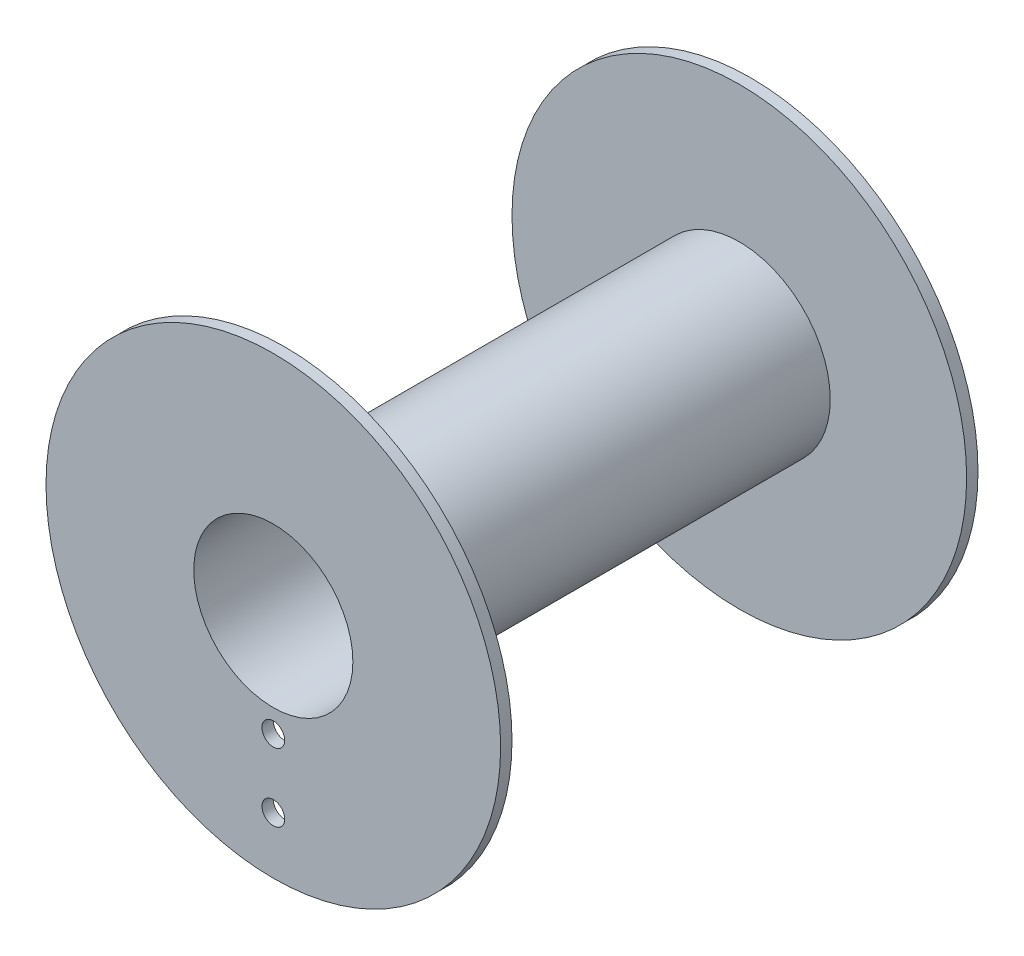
ISO-10303-21;
HEADER;
FILE_DESCRIPTION(('STEP AP214'),'2;1');
FILE_NAME('part.step','',(''),(''),'','','');
FILE_SCHEMA(('AUTOMOTIVE_DESIGN { 1 0 10303 214 1 1 1 1 }'));
ENDSEC;
DATA;
#1=APPLICATION_CONTEXT('core data for automotive mechanical design processes');
#2=APPLICATION_PROTOCOL_DEFINITION('international standard','automotive_design',2000,#1);
#3=PRODUCT_CONTEXT('',#1,'mechanical');
#4=PRODUCT('Part','Part','',(#3));
#5=PRODUCT_RELATED_PRODUCT_CATEGORY('part','',(#4));
#6=PRODUCT_DEFINITION_FORMATION('','',#4);
#7=PRODUCT_DEFINITION_CONTEXT('part definition',#1,'design');
#8=PRODUCT_DEFINITION('design','',#6,#7);
#9=PRODUCT_DEFINITION_SHAPE('','',#8);
#10=(LENGTH_UNIT() NAMED_UNIT(*) SI_UNIT(.MILLI.,.METRE.));
#11=(NAMED_UNIT(*) PLANE_ANGLE_UNIT() SI_UNIT($,.RADIAN.));
#12=(NAMED_UNIT(*) SI_UNIT($,.STERADIAN.) SOLID_ANGLE_UNIT());
#13=UNCERTAINTY_MEASURE_WITH_UNIT(LENGTH_MEASURE(1.E-05),#10,'distance_accuracy_value','');
#14=(GEOMETRIC_REPRESENTATION_CONTEXT(3) GLOBAL_UNCERTAINTY_ASSIGNED_CONTEXT((#13)) GLOBAL_UNIT_ASSIGNED_CONTEXT((#10,
#11,#12)) REPRESENTATION_CONTEXT('',''));
#15=CARTESIAN_POINT('',(0.,0.,0.));
#16=DIRECTION('',(0.,0.,1.));
#17=DIRECTION('',(1.,0.,0.));
#18=AXIS2_PLACEMENT_3D('',#15,#16,#17);
#19=CARTESIAN_POINT('',(0.,0.,1.));
#20=DIRECTION('',(0.,0.,1.));
#21=DIRECTION('',(1.,0.,0.));
#22=AXIS2_PLACEMENT_3D('',#19,#20,#21);
#23=PLANE('',#22);
#24=CARTESIAN_POINT('',(0.,0.,1.));
#25=DIRECTION('',(0.,0.,1.));
#26=DIRECTION('',(1.,0.,0.));
#27=AXIS2_PLACEMENT_3D('',#24,#25,#26);
#28=CIRCLE('',#27,20.);
#29=CARTESIAN_POINT('',(20.,0.,1.));
#30=VERTEX_POINT('',#29);
#31=EDGE_CURVE('E11',#30,#30,#28,.T.);
#32=ORIENTED_EDGE('',*,*,#31,.T.);
#33=EDGE_LOOP('',(#32));
#34=FACE_BOUND('',#33,.T.);
#35=CARTESIAN_POINT('',(0.,0.,1.));
#36=DIRECTION('',(0.,0.,1.));
#37=DIRECTION('',(1.,0.,0.));
#38=AXIS2_PLACEMENT_3D('',#35,#36,#37);
#39=CIRCLE('',#38,8.);
#40=CARTESIAN_POINT('',(8.,0.,1.));
#41=VERTEX_POINT('',#40);
#42=EDGE_CURVE('E60',#41,#41,#39,.T.);
#43=ORIENTED_EDGE('',*,*,#42,.F.);
#44=EDGE_LOOP('',(#43));
#45=FACE_BOUND('',#44,.T.);
#46=ADVANCED_FACE('F26',(#34,#45),#23,.T.);
#47=CARTESIAN_POINT('',(0.,0.,1.));
#48=DIRECTION('',(0.,0.,-1.));
#49=DIRECTION('',(-1.,0.,0.));
#50=AXIS2_PLACEMENT_3D('',#47,#48,#49);
#51=CYLINDRICAL_SURFACE('',#50,20.);
#52=ORIENTED_EDGE('',*,*,#31,.F.);
#53=EDGE_LOOP('',(#52));
#54=FACE_BOUND('',#53,.T.);
#55=CARTESIAN_POINT('',(0.,0.,0.));
#56=DIRECTION('',(0.,0.,1.));
#57=DIRECTION('',(1.,0.,0.));
#58=AXIS2_PLACEMENT_3D('',#55,#56,#57);
#59=CIRCLE('',#58,20.);
#60=CARTESIAN_POINT('',(20.,0.,0.));
#61=VERTEX_POINT('',#60);
#62=EDGE_CURVE('E33',#61,#61,#59,.T.);
#63=ORIENTED_EDGE('',*,*,#62,.T.);
#64=EDGE_LOOP('',(#63));
#65=FACE_BOUND('',#64,.T.);
#66=ADVANCED_FACE('F28',(#54,#65),#51,.T.);
#67=CARTESIAN_POINT('',(0.,0.,0.));
#68=DIRECTION('',(0.,0.,1.));
#69=DIRECTION('',(1.,0.,0.));
#70=AXIS2_PLACEMENT_3D('',#67,#68,#69);
#71=PLANE('',#70);
#72=CARTESIAN_POINT('',(0.,0.,0.));
#73=DIRECTION('',(0.,0.,1.));
#74=DIRECTION('',(1.,0.,0.));
#75=AXIS2_PLACEMENT_3D('',#72,#73,#74);
#76=CIRCLE('',#75,7.);
#77=CARTESIAN_POINT('',(7.,0.,0.));
#78=VERTEX_POINT('',#77);
#79=EDGE_CURVE('E45',#78,#78,#76,.T.);
#80=ORIENTED_EDGE('',*,*,#79,.T.);
#81=EDGE_LOOP('',(#80));
#82=FACE_BOUND('',#81,.T.);
#83=ORIENTED_EDGE('',*,*,#62,.F.);
#84=EDGE_LOOP('',(#83));
#85=FACE_BOUND('',#84,.T.);
#86=ADVANCED_FACE('F68',(#82,#85),#71,.F.);
#87=CARTESIAN_POINT('',(0.,0.,41.));
#88=DIRECTION('',(0.,0.,-1.));
#89=DIRECTION('',(-1.,0.,0.));
#90=AXIS2_PLACEMENT_3D('',#87,#88,#89);
#91=CYLINDRICAL_SURFACE('',#90,8.);
#92=CARTESIAN_POINT('',(0.,0.,41.));
#93=DIRECTION('',(0.,0.,1.));
#94=DIRECTION('',(1.,0.,0.));
#95=AXIS2_PLACEMENT_3D('',#92,#93,#94);
#96=CIRCLE('',#95,8.);
#97=CARTESIAN_POINT('',(0.,-8.,41.));
#98=VERTEX_POINT('',#97);
#99=EDGE_CURVE('E63',#98,#98,#96,.T.);
#100=ORIENTED_EDGE('',*,*,#99,.F.);
#101=EDGE_LOOP('',(#100));
#102=FACE_BOUND('',#101,.T.);
#103=ORIENTED_EDGE('',*,*,#42,.T.);
#104=EDGE_LOOP('',(#103));
#105=FACE_BOUND('',#104,.T.);
#106=ADVANCED_FACE('F70',(#102,#105),#91,.T.);
#107=CARTESIAN_POINT('',(0.,0.,41.));
#108=DIRECTION('',(0.,0.,1.));
#109=DIRECTION('',(1.,0.,0.));
#110=AXIS2_PLACEMENT_3D('',#107,#108,#109);
#111=PLANE('',#110);
#112=CARTESIAN_POINT('',(0.,-15.,41.));
#113=DIRECTION('',(0.,0.,1.));
#114=DIRECTION('',(1.,0.,0.));
#115=AXIS2_PLACEMENT_3D('',#112,#113,#114);
#116=CIRCLE('',#115,1.);
#117=CARTESIAN_POINT('',(1.,-15.,41.));
#118=VERTEX_POINT('',#117);
#119=EDGE_CURVE('E48',#118,#118,#116,.T.);
#120=ORIENTED_EDGE('',*,*,#119,.T.);
#121=EDGE_LOOP('',(#120));
#122=FACE_BOUND('',#121,.T.);
#123=CARTESIAN_POINT('',(0.,0.,41.));
#124=DIRECTION('',(0.,0.,1.));
#125=DIRECTION('',(1.,0.,0.));
#126=AXIS2_PLACEMENT_3D('',#123,#124,#125);
#127=CIRCLE('',#126,20.);
#128=CARTESIAN_POINT('',(20.,0.,41.));
#129=VERTEX_POINT('',#128);
#130=EDGE_CURVE('E54',#129,#129,#127,.T.);
#131=ORIENTED_EDGE('',*,*,#130,.F.);
#132=EDGE_LOOP('',(#131));
#133=FACE_BOUND('',#132,.T.);
#134=ORIENTED_EDGE('',*,*,#99,.T.);
#135=CARTESIAN_POINT('',(0.,-9.,41.));
#136=DIRECTION('',(0.,0.,1.));
#137=DIRECTION('',(1.,0.,0.));
#138=AXIS2_PLACEMENT_3D('',#135,#136,#137);
#139=CIRCLE('',#138,1.);
#140=EDGE_CURVE('E37',#98,#98,#139,.T.);
#141=ORIENTED_EDGE('',*,*,#140,.T.);
#142=EDGE_LOOP('',(#134,#141));
#143=FACE_BOUND('',#142,.T.);
#144=ADVANCED_FACE('F78',(#122,#133,#143),#111,.F.);
#145=CARTESIAN_POINT('',(0.,0.,42.));
#146=DIRECTION('',(0.,0.,-1.));
#147=DIRECTION('',(-1.,0.,0.));
#148=AXIS2_PLACEMENT_3D('',#145,#146,#147);
#149=CYLINDRICAL_SURFACE('',#148,20.);
#150=CARTESIAN_POINT('',(0.,0.,42.));
#151=DIRECTION('',(0.,0.,1.));
#152=DIRECTION('',(1.,0.,0.));
#153=AXIS2_PLACEMENT_3D('',#150,#151,#152);
#154=CIRCLE('',#153,20.);
#155=CARTESIAN_POINT('',(20.,0.,42.));
#156=VERTEX_POINT('',#155);
#157=EDGE_CURVE('E57',#156,#156,#154,.T.);
#158=ORIENTED_EDGE('',*,*,#157,.F.);
#159=EDGE_LOOP('',(#158));
#160=FACE_BOUND('',#159,.T.);
#161=ORIENTED_EDGE('',*,*,#130,.T.);
#162=EDGE_LOOP('',(#161));
#163=FACE_BOUND('',#162,.T.);
#164=ADVANCED_FACE('F96',(#160,#163),#149,.T.);
#165=CARTESIAN_POINT('',(0.,0.,42.));
#166=DIRECTION('',(0.,0.,1.));
#167=DIRECTION('',(1.,0.,0.));
#168=AXIS2_PLACEMENT_3D('',#165,#166,#167);
#169=PLANE('',#168);
#170=CARTESIAN_POINT('',(0.,-15.,42.));
#171=DIRECTION('',(0.,0.,1.));
#172=DIRECTION('',(1.,0.,0.));
#173=AXIS2_PLACEMENT_3D('',#170,#171,#172);
#174=CIRCLE('',#173,1.);
#175=CARTESIAN_POINT('',(1.,-15.,42.));
#176=VERTEX_POINT('',#175);
#177=EDGE_CURVE('E148',#176,#176,#174,.T.);
#178=ORIENTED_EDGE('',*,*,#177,.F.);
#179=EDGE_LOOP('',(#178));
#180=FACE_BOUND('',#179,.T.);
#181=CARTESIAN_POINT('',(0.,-9.,42.));
#182=DIRECTION('',(0.,0.,1.));
#183=DIRECTION('',(1.,0.,0.));
#184=AXIS2_PLACEMENT_3D('',#181,#182,#183);
#185=CIRCLE('',#184,1.);
#186=CARTESIAN_POINT('',(1.,-9.,42.));
#187=VERTEX_POINT('',#186);
#188=EDGE_CURVE('E42',#187,#187,#185,.T.);
#189=ORIENTED_EDGE('',*,*,#188,.F.);
#190=EDGE_LOOP('',(#189));
#191=FACE_BOUND('',#190,.T.);
#192=CARTESIAN_POINT('',(0.,0.,42.));
#193=DIRECTION('',(0.,0.,1.));
#194=DIRECTION('',(1.,0.,0.));
#195=AXIS2_PLACEMENT_3D('',#192,#193,#194);
#196=CIRCLE('',#195,7.);
#197=CARTESIAN_POINT('',(7.,0.,42.));
#198=VERTEX_POINT('',#197);
#199=EDGE_CURVE('E41',#198,#198,#196,.T.);
#200=ORIENTED_EDGE('',*,*,#199,.F.);
#201=EDGE_LOOP('',(#200));
#202=FACE_BOUND('',#201,.T.);
#203=ORIENTED_EDGE('',*,*,#157,.T.);
#204=EDGE_LOOP('',(#203));
#205=FACE_BOUND('',#204,.T.);
#206=ADVANCED_FACE('F99',(#180,#191,#202,#205),#169,.T.);
#207=CARTESIAN_POINT('',(0.,0.,0.));
#208=DIRECTION('',(0.,0.,1.));
#209=DIRECTION('',(1.,0.,0.));
#210=AXIS2_PLACEMENT_3D('',#207,#208,#209);
#211=CYLINDRICAL_SURFACE('',#210,7.);
#212=CARTESIAN_POINT('',(7.,0.,0.));
#213=CARTESIAN_POINT('',(7.,0.,0.437499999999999));
#214=CARTESIAN_POINT('',(7.,0.,0.875));
#215=CARTESIAN_POINT('',(7.,0.,1.75));
#216=CARTESIAN_POINT('',(7.,0.,2.1875));
#217=CARTESIAN_POINT('',(7.,0.,3.0625));
#218=CARTESIAN_POINT('',(7.,0.,3.5));
#219=CARTESIAN_POINT('',(7.,0.,4.375));
#220=CARTESIAN_POINT('',(7.,0.,4.8125));
#221=CARTESIAN_POINT('',(7.,0.,5.6875));
#222=CARTESIAN_POINT('',(7.,0.,6.125));
#223=CARTESIAN_POINT('',(7.,0.,7.));
#224=CARTESIAN_POINT('',(7.,0.,7.4375));
#225=CARTESIAN_POINT('',(7.,0.,8.3125));
#226=CARTESIAN_POINT('',(7.,0.,8.75));
#227=CARTESIAN_POINT('',(7.,0.,9.625));
#228=CARTESIAN_POINT('',(7.,0.,10.0625));
#229=CARTESIAN_POINT('',(7.,0.,10.9375));
#230=CARTESIAN_POINT('',(7.,0.,11.375));
#231=CARTESIAN_POINT('',(7.,0.,12.25));
#232=CARTESIAN_POINT('',(7.,0.,12.6875));
#233=CARTESIAN_POINT('',(7.,0.,13.5625));
#234=CARTESIAN_POINT('',(7.,0.,14.));
#235=CARTESIAN_POINT('',(7.,0.,14.875));
#236=CARTESIAN_POINT('',(7.,0.,15.3125));
#237=CARTESIAN_POINT('',(7.,0.,16.1875));
#238=CARTESIAN_POINT('',(7.,0.,16.625));
#239=CARTESIAN_POINT('',(7.,0.,17.5));
#240=CARTESIAN_POINT('',(7.,0.,17.9375));
#241=CARTESIAN_POINT('',(7.,0.,18.8125));
#242=CARTESIAN_POINT('',(7.,0.,19.25));
#243=CARTESIAN_POINT('',(7.,0.,20.125));
#244=CARTESIAN_POINT('',(7.,0.,20.5625));
#245=CARTESIAN_POINT('',(7.,0.,21.4375));
#246=CARTESIAN_POINT('',(7.,0.,21.875));
#247=CARTESIAN_POINT('',(7.,0.,22.75));
#248=CARTESIAN_POINT('',(7.,0.,23.1875));
#249=CARTESIAN_POINT('',(7.,0.,24.0625));
#250=CARTESIAN_POINT('',(7.,0.,24.5));
#251=CARTESIAN_POINT('',(7.,0.,25.375));
#252=CARTESIAN_POINT('',(7.,0.,25.8125));
#253=CARTESIAN_POINT('',(7.,0.,26.6875));
#254=CARTESIAN_POINT('',(7.,0.,27.125));
#255=CARTESIAN_POINT('',(7.,0.,28.));
#256=CARTESIAN_POINT('',(7.,0.,28.4375));
#257=CARTESIAN_POINT('',(7.,0.,29.3125));
#258=CARTESIAN_POINT('',(7.,0.,29.75));
#259=CARTESIAN_POINT('',(7.,0.,30.625));
#260=CARTESIAN_POINT('',(7.,0.,31.0625));
#261=CARTESIAN_POINT('',(7.,0.,31.9375));
#262=CARTESIAN_POINT('',(7.,0.,32.375));
#263=CARTESIAN_POINT('',(7.,0.,33.25));
#264=CARTESIAN_POINT('',(7.,0.,33.6875));
#265=CARTESIAN_POINT('',(7.,0.,34.5625));
#266=CARTESIAN_POINT('',(7.,0.,35.));
#267=CARTESIAN_POINT('',(7.,0.,35.875));
#268=CARTESIAN_POINT('',(7.,0.,36.3125));
#269=CARTESIAN_POINT('',(7.,0.,37.1875));
#270=CARTESIAN_POINT('',(7.,0.,37.625));
#271=CARTESIAN_POINT('',(7.,0.,38.5));
#272=CARTESIAN_POINT('',(7.,0.,38.9375));
#273=CARTESIAN_POINT('',(7.,0.,39.8125));
#274=CARTESIAN_POINT('',(7.,0.,40.25));
#275=CARTESIAN_POINT('',(7.,0.,41.125));
#276=CARTESIAN_POINT('',(7.,0.,41.5625));
#277=CARTESIAN_POINT('',(7.,0.,42.));
#278=B_SPLINE_CURVE_WITH_KNOTS('',3,(#212,#213,#214,#215,#216,#217,#218,#219,#220,#221,#222,
#223,#224,#225,#226,#227,#228,#229,#230,#231,#232,#233,#234,#235,#236,#237,#238,#239,#240,#241,
#242,#243,#244,#245,#246,#247,#248,#249,#250,#251,#252,#253,#254,#255,#256,#257,#258,#259,#260,
#261,#262,#263,#264,#265,#266,#267,#268,#269,#270,#271,#272,#273,#274,#275,#276,#277),
.UNSPECIFIED.,.F.,.F.,(4,2,2,2,2,2,2,2,2,2,2,2,2,2,2,2,2,2,2,2,2,2,2,2,2,2,2,2,2,2,2,2,4),(0.,
1.3125,2.625,3.9375,5.25,6.5625,7.875,9.1875,10.5,11.8125,13.125,14.4375,15.75,17.0625,18.375,
19.6875,21.,22.3125,23.625,24.9375,26.25,27.5625,28.875,30.1875,31.5,32.8125,34.125,35.4375,
36.75,38.0625,39.375,40.6875,42.),.UNSPECIFIED.);
#279=EDGE_CURVE('BSEAM113',#78,#198,#278,.T.);
#280=ORIENTED_EDGE('',*,*,#79,.F.);
#281=ORIENTED_EDGE('',*,*,#199,.T.);
#282=ORIENTED_EDGE('',*,*,#279,.T.);
#283=ORIENTED_EDGE('',*,*,#279,.F.);
#284=EDGE_LOOP('',(#280,#282,#281,#283));
#285=FACE_BOUND('',#284,.T.);
#286=ADVANCED_FACE('F113',(#285),#211,.F.);
#287=CARTESIAN_POINT('',(0.,-9.,40.));
#288=DIRECTION('',(0.,0.,1.));
#289=DIRECTION('',(1.,0.,0.));
#290=AXIS2_PLACEMENT_3D('',#287,#288,#289);
#291=CYLINDRICAL_SURFACE('',#290,1.);
#292=ORIENTED_EDGE('',*,*,#188,.T.);
#293=EDGE_LOOP('',(#292));
#294=FACE_BOUND('',#293,.T.);
#295=ORIENTED_EDGE('',*,*,#140,.F.);
#296=EDGE_LOOP('',(#295));
#297=FACE_BOUND('',#296,.T.);
#298=ADVANCED_FACE('F38',(#294,#297),#291,.F.);
#299=CARTESIAN_POINT('',(0.,-15.,40.));
#300=DIRECTION('',(0.,0.,1.));
#301=DIRECTION('',(1.,0.,0.));
#302=AXIS2_PLACEMENT_3D('',#299,#300,#301);
#303=CYLINDRICAL_SURFACE('',#302,1.);
#304=ORIENTED_EDGE('',*,*,#177,.T.);
#305=EDGE_LOOP('',(#304));
#306=FACE_BOUND('',#305,.T.);
#307=ORIENTED_EDGE('',*,*,#119,.F.);
#308=EDGE_LOOP('',(#307));
#309=FACE_BOUND('',#308,.T.);
#310=ADVANCED_FACE('F127',(#306,#309),#303,.F.);
#311=CLOSED_SHELL('',(#46,#66,#86,#106,#144,#164,#206,#286,#298,#310));
#312=MANIFOLD_SOLID_BREP('B2',#311);
#313=ADVANCED_BREP_SHAPE_REPRESENTATION('',(#18,#312),#14);
#314=SHAPE_DEFINITION_REPRESENTATION(#9,#313);
ENDSEC;
END-ISO-10303-21;
